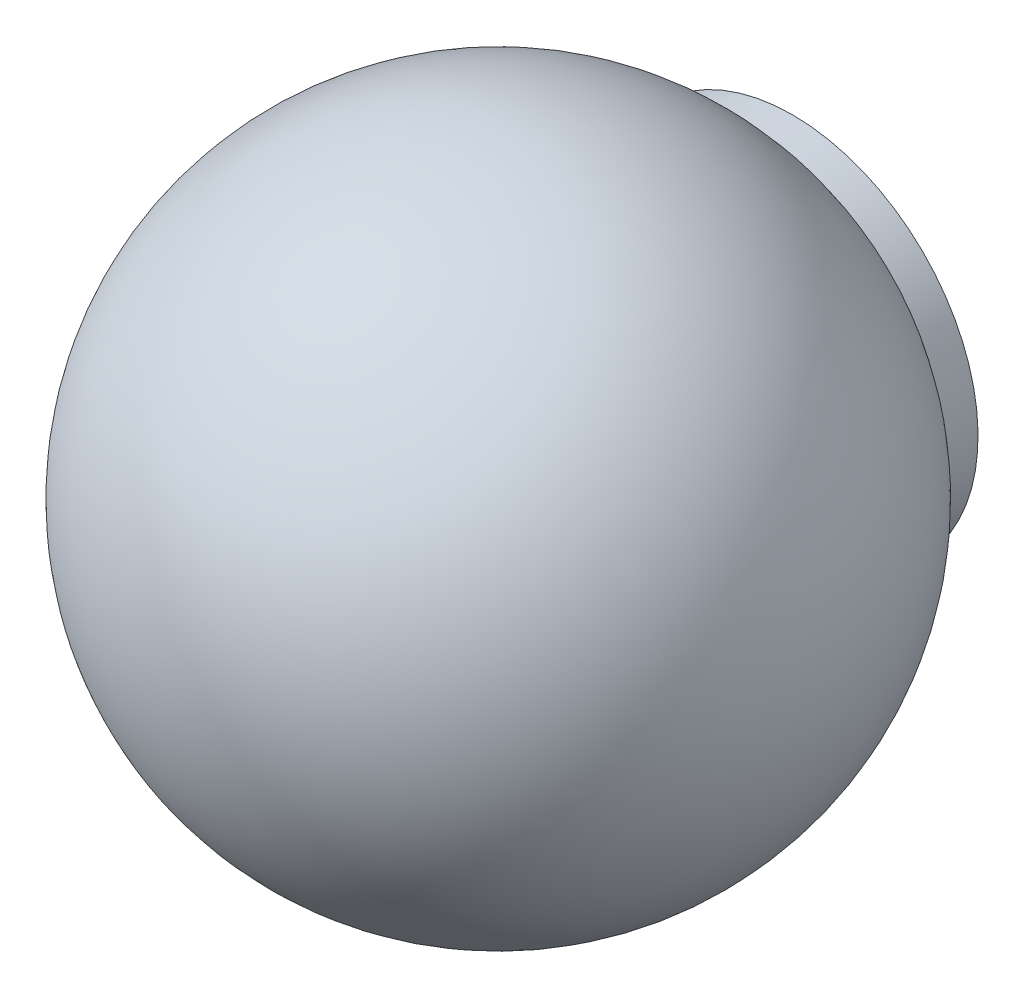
ISO-10303-21;
HEADER;
FILE_DESCRIPTION(('STEP AP214'),'2;1');
FILE_NAME('part.step','',(''),(''),'','','');
FILE_SCHEMA(('AUTOMOTIVE_DESIGN { 1 0 10303 214 1 1 1 1 }'));
ENDSEC;
DATA;
#1=APPLICATION_CONTEXT('core data for automotive mechanical design processes');
#2=APPLICATION_PROTOCOL_DEFINITION('international standard','automotive_design',2000,#1);
#3=PRODUCT_CONTEXT('',#1,'mechanical');
#4=PRODUCT('Part','Part','',(#3));
#5=PRODUCT_RELATED_PRODUCT_CATEGORY('part','',(#4));
#6=PRODUCT_DEFINITION_FORMATION('','',#4);
#7=PRODUCT_DEFINITION_CONTEXT('part definition',#1,'design');
#8=PRODUCT_DEFINITION('design','',#6,#7);
#9=PRODUCT_DEFINITION_SHAPE('','',#8);
#10=(LENGTH_UNIT() NAMED_UNIT(*) SI_UNIT(.MILLI.,.METRE.));
#11=(NAMED_UNIT(*) PLANE_ANGLE_UNIT() SI_UNIT($,.RADIAN.));
#12=(NAMED_UNIT(*) SI_UNIT($,.STERADIAN.) SOLID_ANGLE_UNIT());
#13=UNCERTAINTY_MEASURE_WITH_UNIT(LENGTH_MEASURE(1.E-05),#10,'distance_accuracy_value','');
#14=(GEOMETRIC_REPRESENTATION_CONTEXT(3) GLOBAL_UNCERTAINTY_ASSIGNED_CONTEXT((#13)) GLOBAL_UNIT_ASSIGNED_CONTEXT((#10,
#11,#12)) REPRESENTATION_CONTEXT('',''));
#15=CARTESIAN_POINT('',(0.,0.,0.));
#16=DIRECTION('',(0.,0.,1.));
#17=DIRECTION('',(1.,0.,0.));
#18=AXIS2_PLACEMENT_3D('',#15,#16,#17);
#19=CARTESIAN_POINT('',(-4.,0.,14.));
#20=DIRECTION('',(0.,0.,1.));
#21=DIRECTION('',(0.,-1.,0.));
#22=AXIS2_PLACEMENT_3D('',#19,#20,#21);
#23=PLANE('',#22);
#24=CARTESIAN_POINT('',(0.,0.,14.));
#25=DIRECTION('',(0.,0.,-1.));
#26=DIRECTION('',(0.,1.,0.));
#27=AXIS2_PLACEMENT_3D('',#24,#25,#26);
#28=CIRCLE('',#27,4.);
#29=CARTESIAN_POINT('',(0.,4.,14.));
#30=VERTEX_POINT('',#29);
#31=EDGE_CURVE('E26',#30,#30,#28,.T.);
#32=ORIENTED_EDGE('',*,*,#31,.T.);
#33=EDGE_LOOP('',(#32));
#34=FACE_BOUND('',#33,.T.);
#35=ADVANCED_FACE('F12',(#34),#23,.F.);
#36=CARTESIAN_POINT('',(0.,0.,11.5));
#37=DIRECTION('',(0.,0.,-1.));
#38=DIRECTION('',(-1.,0.,0.));
#39=AXIS2_PLACEMENT_3D('',#36,#37,#38);
#40=SPHERICAL_SURFACE('',#39,12.5);
#41=CARTESIAN_POINT('',(0.,0.,1.31729407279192));
#42=DIRECTION('',(0.,0.,-1.));
#43=DIRECTION('',(0.,1.,0.));
#44=AXIS2_PLACEMENT_3D('',#41,#42,#43);
#45=CIRCLE('',#44,7.25000000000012);
#46=CARTESIAN_POINT('',(0.,7.25000000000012,1.31729407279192));
#47=VERTEX_POINT('',#46);
#48=EDGE_CURVE('E8',#47,#47,#45,.T.);
#49=ORIENTED_EDGE('',*,*,#48,.F.);
#50=EDGE_LOOP('',(#49));
#51=FACE_BOUND('',#50,.T.);
#52=ADVANCED_FACE('F48',(#51),#40,.T.);
#53=CARTESIAN_POINT('',(0.,0.,-4.99999999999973));
#54=DIRECTION('',(0.,0.,-1.));
#55=DIRECTION('',(0.,1.,0.));
#56=AXIS2_PLACEMENT_3D('',#53,#54,#55);
#57=CYLINDRICAL_SURFACE('',#56,7.25);
#58=CARTESIAN_POINT('',(0.,0.,0.));
#59=DIRECTION('',(0.,0.,-1.));
#60=DIRECTION('',(0.,1.,0.));
#61=AXIS2_PLACEMENT_3D('',#58,#59,#60);
#62=CIRCLE('',#61,7.25);
#63=CARTESIAN_POINT('',(0.,7.25,0.));
#64=VERTEX_POINT('',#63);
#65=EDGE_CURVE('E18',#64,#64,#62,.T.);
#66=ORIENTED_EDGE('',*,*,#65,.F.);
#67=EDGE_LOOP('',(#66));
#68=FACE_BOUND('',#67,.T.);
#69=ORIENTED_EDGE('',*,*,#48,.T.);
#70=EDGE_LOOP('',(#69));
#71=FACE_BOUND('',#70,.T.);
#72=ADVANCED_FACE('F41',(#68,#71),#57,.T.);
#73=CARTESIAN_POINT('',(-7.25,0.,0.));
#74=DIRECTION('',(0.,0.,1.));
#75=DIRECTION('',(0.,-1.,0.));
#76=AXIS2_PLACEMENT_3D('',#73,#74,#75);
#77=PLANE('',#76);
#78=CARTESIAN_POINT('',(0.,0.,0.));
#79=DIRECTION('',(0.,0.,-1.));
#80=DIRECTION('',(0.,1.,0.));
#81=AXIS2_PLACEMENT_3D('',#78,#79,#80);
#82=CIRCLE('',#81,4.);
#83=CARTESIAN_POINT('',(0.,4.,0.));
#84=VERTEX_POINT('',#83);
#85=EDGE_CURVE('E22',#84,#84,#82,.T.);
#86=ORIENTED_EDGE('',*,*,#85,.F.);
#87=EDGE_LOOP('',(#86));
#88=FACE_BOUND('',#87,.T.);
#89=ORIENTED_EDGE('',*,*,#65,.T.);
#90=EDGE_LOOP('',(#89));
#91=FACE_BOUND('',#90,.T.);
#92=ADVANCED_FACE('F36',(#88,#91),#77,.F.);
#93=CARTESIAN_POINT('',(0.,0.,-4.99999999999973));
#94=DIRECTION('',(0.,0.,-1.));
#95=DIRECTION('',(0.,1.,0.));
#96=AXIS2_PLACEMENT_3D('',#93,#94,#95);
#97=CYLINDRICAL_SURFACE('',#96,4.);
#98=ORIENTED_EDGE('',*,*,#31,.F.);
#99=EDGE_LOOP('',(#98));
#100=FACE_BOUND('',#99,.T.);
#101=ORIENTED_EDGE('',*,*,#85,.T.);
#102=EDGE_LOOP('',(#101));
#103=FACE_BOUND('',#102,.T.);
#104=ADVANCED_FACE('F33',(#100,#103),#97,.F.);
#105=CLOSED_SHELL('',(#35,#52,#72,#92,#104));
#106=MANIFOLD_SOLID_BREP('B1',#105);
#107=ADVANCED_BREP_SHAPE_REPRESENTATION('',(#18,#106),#14);
#108=SHAPE_DEFINITION_REPRESENTATION(#9,#107);
ENDSEC;
END-ISO-10303-21;
